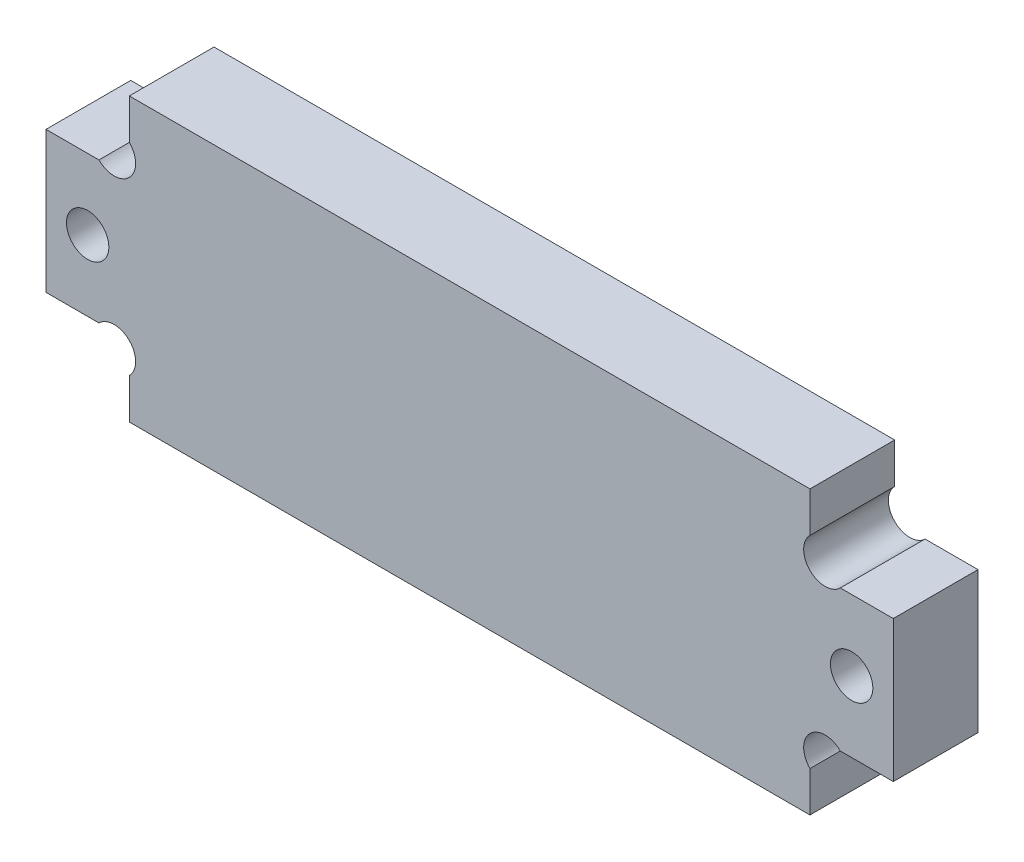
ISO-10303-21;
HEADER;
FILE_DESCRIPTION(('STEP AP214'),'2;1');
FILE_NAME('part.step','',(''),(''),'','','');
FILE_SCHEMA(('AUTOMOTIVE_DESIGN { 1 0 10303 214 1 1 1 1 }'));
ENDSEC;
DATA;
#1=APPLICATION_CONTEXT('core data for automotive mechanical design processes');
#2=APPLICATION_PROTOCOL_DEFINITION('international standard','automotive_design',2000,#1);
#3=PRODUCT_CONTEXT('',#1,'mechanical');
#4=PRODUCT('Part','Part','',(#3));
#5=PRODUCT_RELATED_PRODUCT_CATEGORY('part','',(#4));
#6=PRODUCT_DEFINITION_FORMATION('','',#4);
#7=PRODUCT_DEFINITION_CONTEXT('part definition',#1,'design');
#8=PRODUCT_DEFINITION('design','',#6,#7);
#9=PRODUCT_DEFINITION_SHAPE('','',#8);
#10=(LENGTH_UNIT() NAMED_UNIT(*) SI_UNIT(.MILLI.,.METRE.));
#11=(NAMED_UNIT(*) PLANE_ANGLE_UNIT() SI_UNIT($,.RADIAN.));
#12=(NAMED_UNIT(*) SI_UNIT($,.STERADIAN.) SOLID_ANGLE_UNIT());
#13=UNCERTAINTY_MEASURE_WITH_UNIT(LENGTH_MEASURE(1.E-05),#10,'distance_accuracy_value','');
#14=(GEOMETRIC_REPRESENTATION_CONTEXT(3) GLOBAL_UNCERTAINTY_ASSIGNED_CONTEXT((#13)) GLOBAL_UNIT_ASSIGNED_CONTEXT((#10,
#11,#12)) REPRESENTATION_CONTEXT('',''));
#15=CARTESIAN_POINT('',(0.,0.,0.));
#16=DIRECTION('',(0.,0.,1.));
#17=DIRECTION('',(1.,0.,0.));
#18=AXIS2_PLACEMENT_3D('',#15,#16,#17);
#19=CARTESIAN_POINT('',(4.82519769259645,16.0748023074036,6.));
#20=DIRECTION('',(0.,0.,-1.));
#21=DIRECTION('',(-1.,0.,0.));
#22=AXIS2_PLACEMENT_3D('',#19,#20,#21);
#23=PLANE('',#22);
#24=CARTESIAN_POINT('',(2.95,10.,6.));
#25=DIRECTION('',(0.,0.,1.));
#26=DIRECTION('',(1.,0.,0.));
#27=AXIS2_PLACEMENT_3D('',#24,#25,#26);
#28=CIRCLE('',#27,1.5);
#29=CARTESIAN_POINT('',(4.45,10.,6.));
#30=VERTEX_POINT('',#29);
#31=EDGE_CURVE('E158',#30,#30,#28,.T.);
#32=ORIENTED_EDGE('',*,*,#31,.F.);
#33=EDGE_LOOP('',(#32));
#34=FACE_BOUND('',#33,.T.);
#35=CARTESIAN_POINT('',(4.82519769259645,16.0748023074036,6.));
#36=DIRECTION('',(0.,0.,-1.));
#37=DIRECTION('',(-1.,0.,0.));
#38=AXIS2_PLACEMENT_3D('',#35,#36,#37);
#39=CIRCLE('',#38,1.51999999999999);
#40=CARTESIAN_POINT('',(5.9,17.1496046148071,6.));
#41=VERTEX_POINT('',#40);
#42=CARTESIAN_POINT('',(3.75039538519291,15.,6.));
#43=VERTEX_POINT('',#42);
#44=EDGE_CURVE('E192',#41,#43,#39,.T.);
#45=ORIENTED_EDGE('',*,*,#44,.T.);
#46=DIRECTION('',(-1.,0.,0.));
#47=VECTOR('',#46,1.);
#48=CARTESIAN_POINT('',(0.,15.,6.));
#49=LINE('',#48,#47);
#50=CARTESIAN_POINT('',(0.,15.,6.));
#51=VERTEX_POINT('',#50);
#52=EDGE_CURVE('E153',#43,#51,#49,.T.);
#53=ORIENTED_EDGE('',*,*,#52,.T.);
#54=DIRECTION('',(0.,-1.,0.));
#55=VECTOR('',#54,1.);
#56=CARTESIAN_POINT('',(0.,15.,6.));
#57=LINE('',#56,#55);
#58=CARTESIAN_POINT('',(0.,5.,6.));
#59=VERTEX_POINT('',#58);
#60=EDGE_CURVE('E195',#51,#59,#57,.T.);
#61=ORIENTED_EDGE('',*,*,#60,.T.);
#62=DIRECTION('',(1.,0.,0.));
#63=VECTOR('',#62,1.);
#64=CARTESIAN_POINT('',(0.,5.,6.));
#65=LINE('',#64,#63);
#66=CARTESIAN_POINT('',(3.75039538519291,4.99999999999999,6.));
#67=VERTEX_POINT('',#66);
#68=EDGE_CURVE('E197',#59,#67,#65,.T.);
#69=ORIENTED_EDGE('',*,*,#68,.T.);
#70=CARTESIAN_POINT('',(4.82519769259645,3.92519769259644,6.));
#71=DIRECTION('',(0.,0.,-1.));
#72=DIRECTION('',(1.,0.,0.));
#73=AXIS2_PLACEMENT_3D('',#70,#71,#72);
#74=CIRCLE('',#73,1.51999999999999);
#75=CARTESIAN_POINT('',(5.9,2.8503953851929,6.));
#76=VERTEX_POINT('',#75);
#77=EDGE_CURVE('E199',#67,#76,#74,.T.);
#78=ORIENTED_EDGE('',*,*,#77,.T.);
#79=DIRECTION('',(0.,-1.,0.));
#80=VECTOR('',#79,1.);
#81=CARTESIAN_POINT('',(5.9,2.8503953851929,6.));
#82=LINE('',#81,#80);
#83=CARTESIAN_POINT('',(5.9,0.,6.));
#84=VERTEX_POINT('',#83);
#85=EDGE_CURVE('E201',#76,#84,#82,.T.);
#86=ORIENTED_EDGE('',*,*,#85,.T.);
#87=DIRECTION('',(1.,0.,0.));
#88=VECTOR('',#87,1.);
#89=CARTESIAN_POINT('',(5.9,0.,6.));
#90=LINE('',#89,#88);
#91=CARTESIAN_POINT('',(54.1,0.,6.));
#92=VERTEX_POINT('',#91);
#93=EDGE_CURVE('E203',#84,#92,#90,.T.);
#94=ORIENTED_EDGE('',*,*,#93,.T.);
#95=DIRECTION('',(0.,1.,0.));
#96=VECTOR('',#95,1.);
#97=CARTESIAN_POINT('',(54.1,2.85039538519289,6.));
#98=LINE('',#97,#96);
#99=CARTESIAN_POINT('',(54.1,2.85039538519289,6.));
#100=VERTEX_POINT('',#99);
#101=EDGE_CURVE('E205',#92,#100,#98,.T.);
#102=ORIENTED_EDGE('',*,*,#101,.T.);
#103=CARTESIAN_POINT('',(55.1748023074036,3.92519769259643,6.));
#104=DIRECTION('',(0.,0.,-1.));
#105=DIRECTION('',(-1.,0.,0.));
#106=AXIS2_PLACEMENT_3D('',#103,#104,#105);
#107=CIRCLE('',#106,1.51999999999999);
#108=CARTESIAN_POINT('',(56.2496046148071,4.99999999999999,6.));
#109=VERTEX_POINT('',#108);
#110=EDGE_CURVE('E207',#100,#109,#107,.T.);
#111=ORIENTED_EDGE('',*,*,#110,.T.);
#112=DIRECTION('',(1.,0.,0.));
#113=VECTOR('',#112,1.);
#114=CARTESIAN_POINT('',(60.,5.00000000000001,6.));
#115=LINE('',#114,#113);
#116=CARTESIAN_POINT('',(60.,5.00000000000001,6.));
#117=VERTEX_POINT('',#116);
#118=EDGE_CURVE('E209',#109,#117,#115,.T.);
#119=ORIENTED_EDGE('',*,*,#118,.T.);
#120=DIRECTION('',(0.,1.,0.));
#121=VECTOR('',#120,1.);
#122=CARTESIAN_POINT('',(60.,15.,6.));
#123=LINE('',#122,#121);
#124=CARTESIAN_POINT('',(60.,15.,6.));
#125=VERTEX_POINT('',#124);
#126=EDGE_CURVE('E211',#117,#125,#123,.T.);
#127=ORIENTED_EDGE('',*,*,#126,.T.);
#128=DIRECTION('',(-1.,0.,0.));
#129=VECTOR('',#128,1.);
#130=CARTESIAN_POINT('',(60.,15.,6.));
#131=LINE('',#130,#129);
#132=CARTESIAN_POINT('',(56.2496046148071,15.,6.));
#133=VERTEX_POINT('',#132);
#134=EDGE_CURVE('E213',#125,#133,#131,.T.);
#135=ORIENTED_EDGE('',*,*,#134,.T.);
#136=CARTESIAN_POINT('',(55.1748023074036,16.0748023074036,6.));
#137=DIRECTION('',(0.,0.,-1.));
#138=DIRECTION('',(1.,0.,0.));
#139=AXIS2_PLACEMENT_3D('',#136,#137,#138);
#140=CIRCLE('',#139,1.51999999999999);
#141=CARTESIAN_POINT('',(54.1,17.1496046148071,6.));
#142=VERTEX_POINT('',#141);
#143=EDGE_CURVE('E215',#133,#142,#140,.T.);
#144=ORIENTED_EDGE('',*,*,#143,.T.);
#145=DIRECTION('',(0.,1.,0.));
#146=VECTOR('',#145,1.);
#147=CARTESIAN_POINT('',(54.1,17.1496046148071,6.));
#148=LINE('',#147,#146);
#149=CARTESIAN_POINT('',(54.1,20.,6.));
#150=VERTEX_POINT('',#149);
#151=EDGE_CURVE('E217',#142,#150,#148,.T.);
#152=ORIENTED_EDGE('',*,*,#151,.T.);
#153=DIRECTION('',(-1.,0.,0.));
#154=VECTOR('',#153,1.);
#155=CARTESIAN_POINT('',(54.1,20.,6.));
#156=LINE('',#155,#154);
#157=CARTESIAN_POINT('',(5.9,20.,6.));
#158=VERTEX_POINT('',#157);
#159=EDGE_CURVE('E46',#150,#158,#156,.T.);
#160=ORIENTED_EDGE('',*,*,#159,.T.);
#161=DIRECTION('',(0.,-1.,0.));
#162=VECTOR('',#161,1.);
#163=CARTESIAN_POINT('',(5.9,17.1496046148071,6.));
#164=LINE('',#163,#162);
#165=EDGE_CURVE('E41',#158,#41,#164,.T.);
#166=ORIENTED_EDGE('',*,*,#165,.T.);
#167=EDGE_LOOP('',(#45,#53,#61,#69,#78,#86,#94,#102,#111,#119,#127,#135,#144,#152,#160,#166));
#168=FACE_BOUND('',#167,.T.);
#169=CARTESIAN_POINT('',(57.05,10.,6.));
#170=DIRECTION('',(0.,0.,1.));
#171=DIRECTION('',(-1.,0.,0.));
#172=AXIS2_PLACEMENT_3D('',#169,#170,#171);
#173=CIRCLE('',#172,1.5);
#174=CARTESIAN_POINT('',(55.55,10.,6.));
#175=VERTEX_POINT('',#174);
#176=EDGE_CURVE('E352',#175,#175,#173,.T.);
#177=ORIENTED_EDGE('',*,*,#176,.F.);
#178=EDGE_LOOP('',(#177));
#179=FACE_BOUND('',#178,.T.);
#180=ADVANCED_FACE('F26',(#34,#168,#179),#23,.F.);
#181=CARTESIAN_POINT('',(4.82519769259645,16.0748023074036,0.));
#182=DIRECTION('',(0.,0.,-1.));
#183=DIRECTION('',(-1.,0.,0.));
#184=AXIS2_PLACEMENT_3D('',#181,#182,#183);
#185=PLANE('',#184);
#186=CARTESIAN_POINT('',(2.95,10.,0.));
#187=DIRECTION('',(0.,0.,1.));
#188=DIRECTION('',(1.,0.,0.));
#189=AXIS2_PLACEMENT_3D('',#186,#187,#188);
#190=CIRCLE('',#189,1.5);
#191=CARTESIAN_POINT('',(4.45,10.,0.));
#192=VERTEX_POINT('',#191);
#193=EDGE_CURVE('E161',#192,#192,#190,.T.);
#194=ORIENTED_EDGE('',*,*,#193,.T.);
#195=EDGE_LOOP('',(#194));
#196=FACE_BOUND('',#195,.T.);
#197=CARTESIAN_POINT('',(4.82519769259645,16.0748023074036,0.));
#198=DIRECTION('',(0.,0.,-1.));
#199=DIRECTION('',(-1.,0.,0.));
#200=AXIS2_PLACEMENT_3D('',#197,#198,#199);
#201=CIRCLE('',#200,1.51999999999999);
#202=CARTESIAN_POINT('',(5.9,17.1496046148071,0.));
#203=VERTEX_POINT('',#202);
#204=CARTESIAN_POINT('',(3.75039538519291,15.,0.));
#205=VERTEX_POINT('',#204);
#206=EDGE_CURVE('E144',#203,#205,#201,.T.);
#207=ORIENTED_EDGE('',*,*,#206,.F.);
#208=DIRECTION('',(0.,-1.,0.));
#209=VECTOR('',#208,1.);
#210=CARTESIAN_POINT('',(5.9,17.1496046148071,0.));
#211=LINE('',#210,#209);
#212=CARTESIAN_POINT('',(5.9,20.,0.));
#213=VERTEX_POINT('',#212);
#214=EDGE_CURVE('E190',#213,#203,#211,.T.);
#215=ORIENTED_EDGE('',*,*,#214,.F.);
#216=DIRECTION('',(-1.,0.,0.));
#217=VECTOR('',#216,1.);
#218=CARTESIAN_POINT('',(54.1,20.,0.));
#219=LINE('',#218,#217);
#220=CARTESIAN_POINT('',(54.1,20.,0.));
#221=VERTEX_POINT('',#220);
#222=EDGE_CURVE('E188',#221,#213,#219,.T.);
#223=ORIENTED_EDGE('',*,*,#222,.F.);
#224=DIRECTION('',(0.,1.,0.));
#225=VECTOR('',#224,1.);
#226=CARTESIAN_POINT('',(54.1,17.1496046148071,0.));
#227=LINE('',#226,#225);
#228=CARTESIAN_POINT('',(54.1,17.1496046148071,0.));
#229=VERTEX_POINT('',#228);
#230=EDGE_CURVE('E186',#229,#221,#227,.T.);
#231=ORIENTED_EDGE('',*,*,#230,.F.);
#232=CARTESIAN_POINT('',(55.1748023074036,16.0748023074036,0.));
#233=DIRECTION('',(0.,0.,-1.));
#234=DIRECTION('',(1.,0.,0.));
#235=AXIS2_PLACEMENT_3D('',#232,#233,#234);
#236=CIRCLE('',#235,1.51999999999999);
#237=CARTESIAN_POINT('',(56.2496046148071,15.,0.));
#238=VERTEX_POINT('',#237);
#239=EDGE_CURVE('E184',#238,#229,#236,.T.);
#240=ORIENTED_EDGE('',*,*,#239,.F.);
#241=DIRECTION('',(-1.,0.,0.));
#242=VECTOR('',#241,1.);
#243=CARTESIAN_POINT('',(60.,15.,0.));
#244=LINE('',#243,#242);
#245=CARTESIAN_POINT('',(60.,15.,0.));
#246=VERTEX_POINT('',#245);
#247=EDGE_CURVE('E182',#246,#238,#244,.T.);
#248=ORIENTED_EDGE('',*,*,#247,.F.);
#249=DIRECTION('',(0.,1.,0.));
#250=VECTOR('',#249,1.);
#251=CARTESIAN_POINT('',(60.,15.,0.));
#252=LINE('',#251,#250);
#253=CARTESIAN_POINT('',(60.,5.00000000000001,0.));
#254=VERTEX_POINT('',#253);
#255=EDGE_CURVE('E180',#254,#246,#252,.T.);
#256=ORIENTED_EDGE('',*,*,#255,.F.);
#257=DIRECTION('',(1.,0.,0.));
#258=VECTOR('',#257,1.);
#259=CARTESIAN_POINT('',(60.,5.00000000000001,0.));
#260=LINE('',#259,#258);
#261=CARTESIAN_POINT('',(56.2496046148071,4.99999999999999,0.));
#262=VERTEX_POINT('',#261);
#263=EDGE_CURVE('E178',#262,#254,#260,.T.);
#264=ORIENTED_EDGE('',*,*,#263,.F.);
#265=CARTESIAN_POINT('',(55.1748023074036,3.92519769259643,0.));
#266=DIRECTION('',(0.,0.,-1.));
#267=DIRECTION('',(-1.,0.,0.));
#268=AXIS2_PLACEMENT_3D('',#265,#266,#267);
#269=CIRCLE('',#268,1.51999999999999);
#270=CARTESIAN_POINT('',(54.1,2.85039538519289,0.));
#271=VERTEX_POINT('',#270);
#272=EDGE_CURVE('E176',#271,#262,#269,.T.);
#273=ORIENTED_EDGE('',*,*,#272,.F.);
#274=DIRECTION('',(0.,1.,0.));
#275=VECTOR('',#274,1.);
#276=CARTESIAN_POINT('',(54.1,2.85039538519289,0.));
#277=LINE('',#276,#275);
#278=CARTESIAN_POINT('',(54.1,0.,0.));
#279=VERTEX_POINT('',#278);
#280=EDGE_CURVE('E174',#279,#271,#277,.T.);
#281=ORIENTED_EDGE('',*,*,#280,.F.);
#282=DIRECTION('',(1.,0.,0.));
#283=VECTOR('',#282,1.);
#284=CARTESIAN_POINT('',(5.9,0.,0.));
#285=LINE('',#284,#283);
#286=CARTESIAN_POINT('',(5.9,0.,0.));
#287=VERTEX_POINT('',#286);
#288=EDGE_CURVE('E172',#287,#279,#285,.T.);
#289=ORIENTED_EDGE('',*,*,#288,.F.);
#290=DIRECTION('',(0.,-1.,0.));
#291=VECTOR('',#290,1.);
#292=CARTESIAN_POINT('',(5.9,2.8503953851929,0.));
#293=LINE('',#292,#291);
#294=CARTESIAN_POINT('',(5.9,2.8503953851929,0.));
#295=VERTEX_POINT('',#294);
#296=EDGE_CURVE('E170',#295,#287,#293,.T.);
#297=ORIENTED_EDGE('',*,*,#296,.F.);
#298=CARTESIAN_POINT('',(4.82519769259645,3.92519769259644,0.));
#299=DIRECTION('',(0.,0.,-1.));
#300=DIRECTION('',(1.,0.,0.));
#301=AXIS2_PLACEMENT_3D('',#298,#299,#300);
#302=CIRCLE('',#301,1.51999999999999);
#303=CARTESIAN_POINT('',(3.75039538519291,4.99999999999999,0.));
#304=VERTEX_POINT('',#303);
#305=EDGE_CURVE('E168',#304,#295,#302,.T.);
#306=ORIENTED_EDGE('',*,*,#305,.F.);
#307=DIRECTION('',(1.,0.,0.));
#308=VECTOR('',#307,1.);
#309=CARTESIAN_POINT('',(0.,5.,0.));
#310=LINE('',#309,#308);
#311=CARTESIAN_POINT('',(0.,5.,0.));
#312=VERTEX_POINT('',#311);
#313=EDGE_CURVE('E166',#312,#304,#310,.T.);
#314=ORIENTED_EDGE('',*,*,#313,.F.);
#315=DIRECTION('',(0.,-1.,0.));
#316=VECTOR('',#315,1.);
#317=CARTESIAN_POINT('',(0.,15.,0.));
#318=LINE('',#317,#316);
#319=CARTESIAN_POINT('',(0.,15.,0.));
#320=VERTEX_POINT('',#319);
#321=EDGE_CURVE('E146',#320,#312,#318,.T.);
#322=ORIENTED_EDGE('',*,*,#321,.F.);
#323=DIRECTION('',(-1.,0.,0.));
#324=VECTOR('',#323,1.);
#325=CARTESIAN_POINT('',(0.,15.,0.));
#326=LINE('',#325,#324);
#327=EDGE_CURVE('E139',#205,#320,#326,.T.);
#328=ORIENTED_EDGE('',*,*,#327,.F.);
#329=EDGE_LOOP('',(#207,#215,#223,#231,#240,#248,#256,#264,#273,#281,#289,#297,#306,#314,#322,#328));
#330=FACE_BOUND('',#329,.T.);
#331=CARTESIAN_POINT('',(57.05,10.,0.));
#332=DIRECTION('',(0.,0.,1.));
#333=DIRECTION('',(-1.,0.,0.));
#334=AXIS2_PLACEMENT_3D('',#331,#332,#333);
#335=CIRCLE('',#334,1.5);
#336=CARTESIAN_POINT('',(55.55,10.,0.));
#337=VERTEX_POINT('',#336);
#338=EDGE_CURVE('E355',#337,#337,#335,.T.);
#339=ORIENTED_EDGE('',*,*,#338,.T.);
#340=EDGE_LOOP('',(#339));
#341=FACE_BOUND('',#340,.T.);
#342=ADVANCED_FACE('F140',(#196,#330,#341),#185,.T.);
#343=CARTESIAN_POINT('',(4.82519769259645,16.0748023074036,6.));
#344=DIRECTION('',(0.,0.,-1.));
#345=DIRECTION('',(-1.,0.,0.));
#346=AXIS2_PLACEMENT_3D('',#343,#344,#345);
#347=CYLINDRICAL_SURFACE('',#346,1.51999999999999);
#348=ORIENTED_EDGE('',*,*,#206,.T.);
#349=DIRECTION('',(0.,0.,-1.));
#350=VECTOR('',#349,1.);
#351=CARTESIAN_POINT('',(3.75039538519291,15.,6.));
#352=LINE('',#351,#350);
#353=EDGE_CURVE('E11',#43,#205,#352,.T.);
#354=ORIENTED_EDGE('',*,*,#353,.F.);
#355=ORIENTED_EDGE('',*,*,#44,.F.);
#356=DIRECTION('',(0.,0.,-1.));
#357=VECTOR('',#356,1.);
#358=CARTESIAN_POINT('',(5.9,17.1496046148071,6.));
#359=LINE('',#358,#357);
#360=EDGE_CURVE('E157',#41,#203,#359,.T.);
#361=ORIENTED_EDGE('',*,*,#360,.T.);
#362=EDGE_LOOP('',(#348,#354,#355,#361));
#363=FACE_BOUND('',#362,.T.);
#364=ADVANCED_FACE('F28',(#363),#347,.F.);
#365=CARTESIAN_POINT('',(0.,15.,6.));
#366=DIRECTION('',(0.,-1.,0.));
#367=DIRECTION('',(0.,0.,-1.));
#368=AXIS2_PLACEMENT_3D('',#365,#366,#367);
#369=PLANE('',#368);
#370=ORIENTED_EDGE('',*,*,#327,.T.);
#371=DIRECTION('',(0.,0.,-1.));
#372=VECTOR('',#371,1.);
#373=CARTESIAN_POINT('',(0.,15.,6.));
#374=LINE('',#373,#372);
#375=EDGE_CURVE('E34',#51,#320,#374,.T.);
#376=ORIENTED_EDGE('',*,*,#375,.F.);
#377=ORIENTED_EDGE('',*,*,#52,.F.);
#378=ORIENTED_EDGE('',*,*,#353,.T.);
#379=EDGE_LOOP('',(#370,#376,#377,#378));
#380=FACE_BOUND('',#379,.T.);
#381=ADVANCED_FACE('F152',(#380),#369,.F.);
#382=CARTESIAN_POINT('',(0.,15.,6.));
#383=DIRECTION('',(1.,0.,0.));
#384=DIRECTION('',(0.,1.,0.));
#385=AXIS2_PLACEMENT_3D('',#382,#383,#384);
#386=PLANE('',#385);
#387=ORIENTED_EDGE('',*,*,#321,.T.);
#388=DIRECTION('',(0.,0.,-1.));
#389=VECTOR('',#388,1.);
#390=CARTESIAN_POINT('',(0.,5.,6.));
#391=LINE('',#390,#389);
#392=EDGE_CURVE('E258',#59,#312,#391,.T.);
#393=ORIENTED_EDGE('',*,*,#392,.F.);
#394=ORIENTED_EDGE('',*,*,#60,.F.);
#395=ORIENTED_EDGE('',*,*,#375,.T.);
#396=EDGE_LOOP('',(#387,#393,#394,#395));
#397=FACE_BOUND('',#396,.T.);
#398=ADVANCED_FACE('F262',(#397),#386,.F.);
#399=CARTESIAN_POINT('',(0.,5.,6.));
#400=DIRECTION('',(0.,1.,0.));
#401=DIRECTION('',(-1.,0.,0.));
#402=AXIS2_PLACEMENT_3D('',#399,#400,#401);
#403=PLANE('',#402);
#404=ORIENTED_EDGE('',*,*,#313,.T.);
#405=DIRECTION('',(0.,0.,-1.));
#406=VECTOR('',#405,1.);
#407=CARTESIAN_POINT('',(3.75039538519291,4.99999999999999,6.));
#408=LINE('',#407,#406);
#409=EDGE_CURVE('E255',#67,#304,#408,.T.);
#410=ORIENTED_EDGE('',*,*,#409,.F.);
#411=ORIENTED_EDGE('',*,*,#68,.F.);
#412=ORIENTED_EDGE('',*,*,#392,.T.);
#413=EDGE_LOOP('',(#404,#410,#411,#412));
#414=FACE_BOUND('',#413,.T.);
#415=ADVANCED_FACE('F270',(#414),#403,.F.);
#416=CARTESIAN_POINT('',(4.82519769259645,3.92519769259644,6.));
#417=DIRECTION('',(0.,0.,-1.));
#418=DIRECTION('',(-1.,0.,0.));
#419=AXIS2_PLACEMENT_3D('',#416,#417,#418);
#420=CYLINDRICAL_SURFACE('',#419,1.51999999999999);
#421=ORIENTED_EDGE('',*,*,#305,.T.);
#422=DIRECTION('',(0.,0.,-1.));
#423=VECTOR('',#422,1.);
#424=CARTESIAN_POINT('',(5.9,2.8503953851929,6.));
#425=LINE('',#424,#423);
#426=EDGE_CURVE('E252',#76,#295,#425,.T.);
#427=ORIENTED_EDGE('',*,*,#426,.F.);
#428=ORIENTED_EDGE('',*,*,#77,.F.);
#429=ORIENTED_EDGE('',*,*,#409,.T.);
#430=EDGE_LOOP('',(#421,#427,#428,#429));
#431=FACE_BOUND('',#430,.T.);
#432=ADVANCED_FACE('F273',(#431),#420,.F.);
#433=CARTESIAN_POINT('',(5.9,2.8503953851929,6.));
#434=DIRECTION('',(1.,0.,0.));
#435=DIRECTION('',(0.,1.,0.));
#436=AXIS2_PLACEMENT_3D('',#433,#434,#435);
#437=PLANE('',#436);
#438=ORIENTED_EDGE('',*,*,#296,.T.);
#439=DIRECTION('',(0.,0.,-1.));
#440=VECTOR('',#439,1.);
#441=CARTESIAN_POINT('',(5.9,0.,6.));
#442=LINE('',#441,#440);
#443=EDGE_CURVE('E249',#84,#287,#442,.T.);
#444=ORIENTED_EDGE('',*,*,#443,.F.);
#445=ORIENTED_EDGE('',*,*,#85,.F.);
#446=ORIENTED_EDGE('',*,*,#426,.T.);
#447=EDGE_LOOP('',(#438,#444,#445,#446));
#448=FACE_BOUND('',#447,.T.);
#449=ADVANCED_FACE('F278',(#448),#437,.F.);
#450=CARTESIAN_POINT('',(5.9,0.,6.));
#451=DIRECTION('',(0.,1.,0.));
#452=DIRECTION('',(-1.,0.,0.));
#453=AXIS2_PLACEMENT_3D('',#450,#451,#452);
#454=PLANE('',#453);
#455=ORIENTED_EDGE('',*,*,#288,.T.);
#456=DIRECTION('',(0.,0.,-1.));
#457=VECTOR('',#456,1.);
#458=CARTESIAN_POINT('',(54.1,0.,6.));
#459=LINE('',#458,#457);
#460=EDGE_CURVE('E246',#92,#279,#459,.T.);
#461=ORIENTED_EDGE('',*,*,#460,.F.);
#462=ORIENTED_EDGE('',*,*,#93,.F.);
#463=ORIENTED_EDGE('',*,*,#443,.T.);
#464=EDGE_LOOP('',(#455,#461,#462,#463));
#465=FACE_BOUND('',#464,.T.);
#466=ADVANCED_FACE('F284',(#465),#454,.F.);
#467=CARTESIAN_POINT('',(54.1,2.85039538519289,6.));
#468=DIRECTION('',(-1.,0.,0.));
#469=DIRECTION('',(0.,-1.,0.));
#470=AXIS2_PLACEMENT_3D('',#467,#468,#469);
#471=PLANE('',#470);
#472=ORIENTED_EDGE('',*,*,#280,.T.);
#473=DIRECTION('',(0.,0.,-1.));
#474=VECTOR('',#473,1.);
#475=CARTESIAN_POINT('',(54.1,2.85039538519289,6.));
#476=LINE('',#475,#474);
#477=EDGE_CURVE('E243',#100,#271,#476,.T.);
#478=ORIENTED_EDGE('',*,*,#477,.F.);
#479=ORIENTED_EDGE('',*,*,#101,.F.);
#480=ORIENTED_EDGE('',*,*,#460,.T.);
#481=EDGE_LOOP('',(#472,#478,#479,#480));
#482=FACE_BOUND('',#481,.T.);
#483=ADVANCED_FACE('F288',(#482),#471,.F.);
#484=CARTESIAN_POINT('',(55.1748023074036,3.92519769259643,6.));
#485=DIRECTION('',(0.,0.,-1.));
#486=DIRECTION('',(-1.,0.,0.));
#487=AXIS2_PLACEMENT_3D('',#484,#485,#486);
#488=CYLINDRICAL_SURFACE('',#487,1.51999999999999);
#489=ORIENTED_EDGE('',*,*,#272,.T.);
#490=DIRECTION('',(0.,0.,-1.));
#491=VECTOR('',#490,1.);
#492=CARTESIAN_POINT('',(56.2496046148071,4.99999999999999,6.));
#493=LINE('',#492,#491);
#494=EDGE_CURVE('E240',#109,#262,#493,.T.);
#495=ORIENTED_EDGE('',*,*,#494,.F.);
#496=ORIENTED_EDGE('',*,*,#110,.F.);
#497=ORIENTED_EDGE('',*,*,#477,.T.);
#498=EDGE_LOOP('',(#489,#495,#496,#497));
#499=FACE_BOUND('',#498,.T.);
#500=ADVANCED_FACE('F293',(#499),#488,.F.);
#501=CARTESIAN_POINT('',(60.,5.00000000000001,6.));
#502=DIRECTION('',(0.,1.,0.));
#503=DIRECTION('',(-1.,0.,0.));
#504=AXIS2_PLACEMENT_3D('',#501,#502,#503);
#505=PLANE('',#504);
#506=ORIENTED_EDGE('',*,*,#263,.T.);
#507=DIRECTION('',(0.,0.,-1.));
#508=VECTOR('',#507,1.);
#509=CARTESIAN_POINT('',(60.,5.00000000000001,6.));
#510=LINE('',#509,#508);
#511=EDGE_CURVE('E237',#117,#254,#510,.T.);
#512=ORIENTED_EDGE('',*,*,#511,.F.);
#513=ORIENTED_EDGE('',*,*,#118,.F.);
#514=ORIENTED_EDGE('',*,*,#494,.T.);
#515=EDGE_LOOP('',(#506,#512,#513,#514));
#516=FACE_BOUND('',#515,.T.);
#517=ADVANCED_FACE('F299',(#516),#505,.F.);
#518=CARTESIAN_POINT('',(60.,15.,6.));
#519=DIRECTION('',(-1.,0.,0.));
#520=DIRECTION('',(0.,-1.,0.));
#521=AXIS2_PLACEMENT_3D('',#518,#519,#520);
#522=PLANE('',#521);
#523=ORIENTED_EDGE('',*,*,#255,.T.);
#524=DIRECTION('',(0.,0.,-1.));
#525=VECTOR('',#524,1.);
#526=CARTESIAN_POINT('',(60.,15.,6.));
#527=LINE('',#526,#525);
#528=EDGE_CURVE('E234',#125,#246,#527,.T.);
#529=ORIENTED_EDGE('',*,*,#528,.F.);
#530=ORIENTED_EDGE('',*,*,#126,.F.);
#531=ORIENTED_EDGE('',*,*,#511,.T.);
#532=EDGE_LOOP('',(#523,#529,#530,#531));
#533=FACE_BOUND('',#532,.T.);
#534=ADVANCED_FACE('F303',(#533),#522,.F.);
#535=CARTESIAN_POINT('',(60.,15.,6.));
#536=DIRECTION('',(0.,-1.,0.));
#537=DIRECTION('',(0.,0.,-1.));
#538=AXIS2_PLACEMENT_3D('',#535,#536,#537);
#539=PLANE('',#538);
#540=ORIENTED_EDGE('',*,*,#247,.T.);
#541=DIRECTION('',(0.,0.,-1.));
#542=VECTOR('',#541,1.);
#543=CARTESIAN_POINT('',(56.2496046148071,15.,6.));
#544=LINE('',#543,#542);
#545=EDGE_CURVE('E231',#133,#238,#544,.T.);
#546=ORIENTED_EDGE('',*,*,#545,.F.);
#547=ORIENTED_EDGE('',*,*,#134,.F.);
#548=ORIENTED_EDGE('',*,*,#528,.T.);
#549=EDGE_LOOP('',(#540,#546,#547,#548));
#550=FACE_BOUND('',#549,.T.);
#551=ADVANCED_FACE('F308',(#550),#539,.F.);
#552=CARTESIAN_POINT('',(55.1748023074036,16.0748023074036,6.));
#553=DIRECTION('',(0.,0.,-1.));
#554=DIRECTION('',(-1.,0.,0.));
#555=AXIS2_PLACEMENT_3D('',#552,#553,#554);
#556=CYLINDRICAL_SURFACE('',#555,1.51999999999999);
#557=ORIENTED_EDGE('',*,*,#239,.T.);
#558=DIRECTION('',(0.,0.,-1.));
#559=VECTOR('',#558,1.);
#560=CARTESIAN_POINT('',(54.1,17.1496046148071,6.));
#561=LINE('',#560,#559);
#562=EDGE_CURVE('E228',#142,#229,#561,.T.);
#563=ORIENTED_EDGE('',*,*,#562,.F.);
#564=ORIENTED_EDGE('',*,*,#143,.F.);
#565=ORIENTED_EDGE('',*,*,#545,.T.);
#566=EDGE_LOOP('',(#557,#563,#564,#565));
#567=FACE_BOUND('',#566,.T.);
#568=ADVANCED_FACE('F314',(#567),#556,.F.);
#569=CARTESIAN_POINT('',(54.1,17.1496046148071,6.));
#570=DIRECTION('',(-1.,0.,0.));
#571=DIRECTION('',(0.,-1.,0.));
#572=AXIS2_PLACEMENT_3D('',#569,#570,#571);
#573=PLANE('',#572);
#574=ORIENTED_EDGE('',*,*,#230,.T.);
#575=DIRECTION('',(0.,0.,-1.));
#576=VECTOR('',#575,1.);
#577=CARTESIAN_POINT('',(54.1,20.,6.));
#578=LINE('',#577,#576);
#579=EDGE_CURVE('E225',#150,#221,#578,.T.);
#580=ORIENTED_EDGE('',*,*,#579,.F.);
#581=ORIENTED_EDGE('',*,*,#151,.F.);
#582=ORIENTED_EDGE('',*,*,#562,.T.);
#583=EDGE_LOOP('',(#574,#580,#581,#582));
#584=FACE_BOUND('',#583,.T.);
#585=ADVANCED_FACE('F318',(#584),#573,.F.);
#586=CARTESIAN_POINT('',(54.1,20.,6.));
#587=DIRECTION('',(0.,-1.,0.));
#588=DIRECTION('',(1.,0.,0.));
#589=AXIS2_PLACEMENT_3D('',#586,#587,#588);
#590=PLANE('',#589);
#591=ORIENTED_EDGE('',*,*,#222,.T.);
#592=DIRECTION('',(0.,0.,-1.));
#593=VECTOR('',#592,1.);
#594=CARTESIAN_POINT('',(5.9,20.,6.));
#595=LINE('',#594,#593);
#596=EDGE_CURVE('E222',#158,#213,#595,.T.);
#597=ORIENTED_EDGE('',*,*,#596,.F.);
#598=ORIENTED_EDGE('',*,*,#159,.F.);
#599=ORIENTED_EDGE('',*,*,#579,.T.);
#600=EDGE_LOOP('',(#591,#597,#598,#599));
#601=FACE_BOUND('',#600,.T.);
#602=ADVANCED_FACE('F321',(#601),#590,.F.);
#603=CARTESIAN_POINT('',(5.9,17.1496046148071,6.));
#604=DIRECTION('',(1.,0.,0.));
#605=DIRECTION('',(0.,1.,0.));
#606=AXIS2_PLACEMENT_3D('',#603,#604,#605);
#607=PLANE('',#606);
#608=ORIENTED_EDGE('',*,*,#214,.T.);
#609=ORIENTED_EDGE('',*,*,#360,.F.);
#610=ORIENTED_EDGE('',*,*,#165,.F.);
#611=ORIENTED_EDGE('',*,*,#596,.T.);
#612=EDGE_LOOP('',(#608,#609,#610,#611));
#613=FACE_BOUND('',#612,.T.);
#614=ADVANCED_FACE('F323',(#613),#607,.F.);
#615=CARTESIAN_POINT('',(2.95,10.,6.));
#616=DIRECTION('',(0.,0.,-1.));
#617=DIRECTION('',(-1.,0.,0.));
#618=AXIS2_PLACEMENT_3D('',#615,#616,#617);
#619=CYLINDRICAL_SURFACE('',#618,1.5);
#620=ORIENTED_EDGE('',*,*,#31,.T.);
#621=EDGE_LOOP('',(#620));
#622=FACE_BOUND('',#621,.T.);
#623=ORIENTED_EDGE('',*,*,#193,.F.);
#624=EDGE_LOOP('',(#623));
#625=FACE_BOUND('',#624,.T.);
#626=ADVANCED_FACE('F325',(#622,#625),#619,.F.);
#627=CARTESIAN_POINT('',(57.05,10.,6.));
#628=DIRECTION('',(0.,0.,-1.));
#629=DIRECTION('',(-1.,0.,0.));
#630=AXIS2_PLACEMENT_3D('',#627,#628,#629);
#631=CYLINDRICAL_SURFACE('',#630,1.5);
#632=ORIENTED_EDGE('',*,*,#176,.T.);
#633=EDGE_LOOP('',(#632));
#634=FACE_BOUND('',#633,.T.);
#635=ORIENTED_EDGE('',*,*,#338,.F.);
#636=EDGE_LOOP('',(#635));
#637=FACE_BOUND('',#636,.T.);
#638=ADVANCED_FACE('F331',(#634,#637),#631,.F.);
#639=CLOSED_SHELL('',(#180,#342,#364,#381,#398,#415,#432,#449,#466,#483,#500,#517,#534,#551,
#568,#585,#602,#614,#626,#638));
#640=MANIFOLD_SOLID_BREP('B2',#639);
#641=ADVANCED_BREP_SHAPE_REPRESENTATION('',(#18,#640),#14);
#642=SHAPE_DEFINITION_REPRESENTATION(#9,#641);
ENDSEC;
END-ISO-10303-21;
